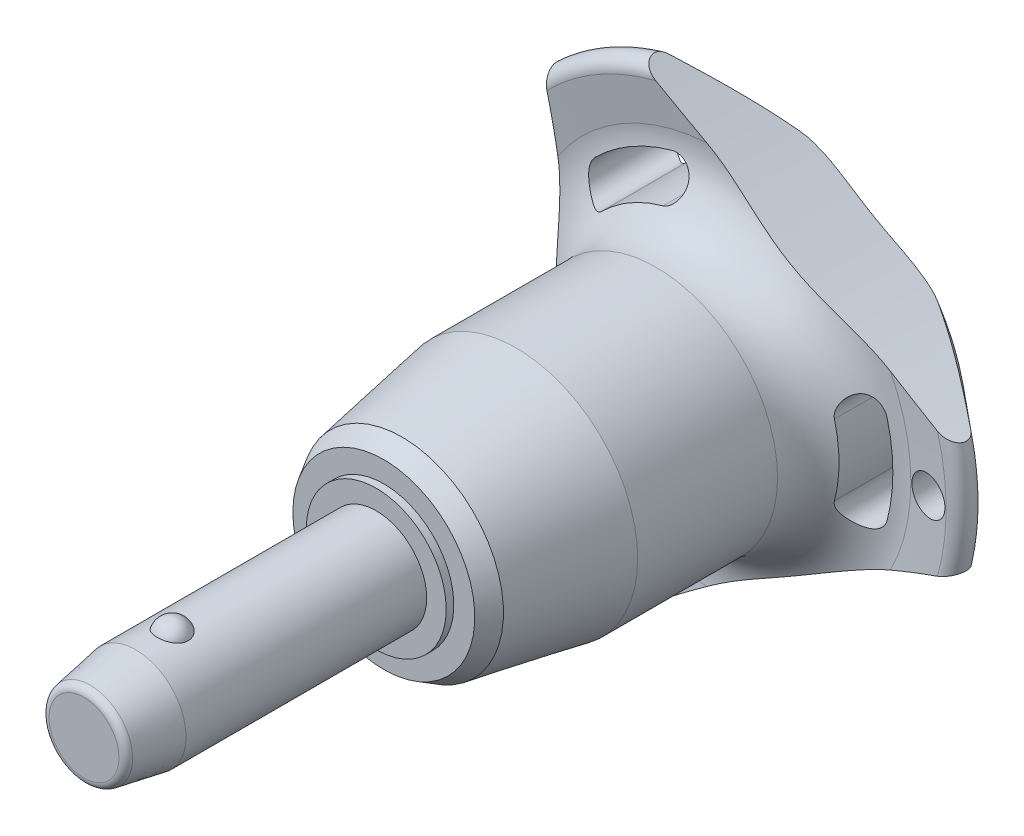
from build123d import *

# Parameters (mm, degrees)
SKETCH1_R           = 4
BOSS_EXTRUDE1_DEPTH = 15
SKETCH2_R           = 3.4
BOSS_EXTRUDE2_DEPTH = 33.3
BOSS_EXTRUDE3_START = 8.2
SKETCH1_2_R         = 4
BOSS_EXTRUDE3_DEPTH = 8.2
CHAMFER1_SIZE       = 4.1
CHAMFER1_SIZE2      = 0.722940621
FILLET1_R           = 0.6
SKETCH6_R           = 102.8
CUT_EXTRUDE1_DEPTH  = 56.691633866
CIRPATTERN1_COUNT   = 3
SKETCH7_R           = 1.5
CUT_EXTRUDE2_DEPTH  = 56.400455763


with BuildPart() as part:
    # Sketch1 → Boss-Extrude1 (new body)
    with BuildSketch(Plane.XY):
        Circle(SKETCH1_R)
    extrude(amount=-BOSS_EXTRUDE1_DEPTH)

    # Sketch2 → Boss-Extrude2 (add)
    with BuildSketch(Plane(origin=(0, 0, -15), x_dir=(-1, 0, 0), z_dir=(0, 0, -1))):
        Circle(SKETCH2_R)
    extrude(amount=BOSS_EXTRUDE2_DEPTH)

    # Sketch3 → Revolve1 (revolve)
    with BuildSketch(Plane(origin=(0, 0, 0), x_dir=(0, 0, -1), z_dir=(1, 0, 0))):
        with BuildLine():
            Line((-1.2, 4.8), (-1.2, 2.2))
            ThreePointArc((-1.2, 2.2), (0.1, 3.5), (-1.2, 4.8))
        make_face()
        with BuildLine():
            Line((-1.2, -2.2), (-1.2, -4.8))
            ThreePointArc((-1.2, -4.8), (0.1, -3.5), (-1.2, -2.2))
        make_face()
    revolve(axis=Axis((0, -2.2, 1.2), (0, 1, 0)))

    # Sketch1_2 → Boss-Extrude3 (add)
    with BuildSketch(Plane.XY.offset(BOSS_EXTRUDE3_START)):
        Circle(SKETCH1_2_R)
    extrude(amount=-BOSS_EXTRUDE3_DEPTH)

    # Chamfer1
    chamfer1_edges = [part.edges().sort_by_distance(p)[0] for p in [
        (-4, 0, 8.2),
    ]]
    chamfer1_side = [part.faces().sort_by_distance(p)[0] for p in [
        (-4, 0, -3.4),
    ]]
    chamfer(chamfer1_edges, length=CHAMFER1_SIZE, length2=CHAMFER1_SIZE2, reference=chamfer1_side[0])

    # Fillet1
    fillet1_edges = [part.edges().sort_by_distance(p)[0] for p in [
        (-3.277059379, 0, 8.2),
        (3.4, 0, -48.3),
    ]]
    fillet(fillet1_edges, radius=FILLET1_R)

    # Sketch4 → Revolve2 (revolve)
    with BuildSketch(Plane(origin=(0, 0, 0), x_dir=(0, 0, -1), z_dir=(1, 0, 0)), mode=Mode.PRIVATE) as revolve2_sk:
        Polygon((15, 0), (15, 5.554101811), (15.6, 5.554101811), (15.6, 7.220004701), (17.042714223, 8.052956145), (26.1, 9.65), (37.2, 9.65), (37.2, 0), align=None)
    revolve(revolve2_sk.sketch.rotate(Axis((0, 0, -37.2), (0, 0, 1)), 90), axis=Axis((0, 0, -37.2), (0, 0, 1)))

    # Sketch5 → Revolve3 (revolve)
    with BuildSketch(Plane(origin=(0, 0, 0), x_dir=(0, 0, -1), z_dir=(1, 0, 0)), mode=Mode.PRIVATE) as revolve3_sk:
        with BuildLine():
            Line((42.16082631, 15.274661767), (41.757834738, 18.475067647))
            ThreePointArc((41.757834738, 18.475067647), (42.349836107, 19.516443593), (43.516044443, 19.24278761))
            Line((43.516044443, 19.24278761), (47.835691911, 14.094832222))
            ThreePointArc((47.835691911, 14.094832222), (48.3, 12.689260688), (47.67067517, 11.349423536))
            ThreePointArc((47.67067517, 11.349423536), (44.033110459, 6.185112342), (42.75, 0))
            Line((42.75, 0), (37.2, 0))
            Line((37.2, 0), (37.2, 9.65))
            ThreePointArc((37.2, 9.65), (40.949887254, 11.342683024), (42.16082631, 15.274661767))
        make_face()
    revolve(revolve3_sk.sketch.rotate(Axis((0, 0, -42.75), (0, 0, 1)), 90), axis=Axis((0, 0, -42.75), (0, 0, 1)))

    # Sketch6 → Cut-Extrude1 (cut, through all)
    with BuildSketch(Plane.XY):
        with Locations((-115.2, 0)):
            Circle(SKETCH6_R)
        with BuildLine():
            ThreePointArc((13.411913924, -3.529271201), (13.868496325, 0), (13.411913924, 3.529271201))
            ThreePointArc((13.411913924, 3.529271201), (11.694200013, 4.531299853), (10.692171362, 2.813585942))
            ThreePointArc((10.692171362, 2.813585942), (11.056165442, 0), (10.692171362, -2.813585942))
            ThreePointArc((10.692171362, -2.813585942), (11.694200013, -4.531299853), (13.411913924, -3.529271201))
        make_face()
    cut_extrude1 = extrude(amount=-CUT_EXTRUDE1_DEPTH, mode=Mode.SUBTRACT)

    # CirPattern1: Cut-Extrude1 ×3 about axis
    cirpattern1_axis = Axis((0, 0, 0), (0, 0, 1))
    for i in range(1, CIRPATTERN1_COUNT):
        add(cut_extrude1.rotate(cirpattern1_axis, i * 360 / CIRPATTERN1_COUNT), mode=Mode.SUBTRACT)

    # Sketch7 → Cut-Extrude2 (cut, through all)
    with BuildSketch(Plane.XY):
        with Locations(Location((16.868496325, 0, 0), (0, 0, 225.467095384))):
            Circle(SKETCH7_R)
    extrude(amount=-CUT_EXTRUDE2_DEPTH, mode=Mode.SUBTRACT)


solid = part.part
